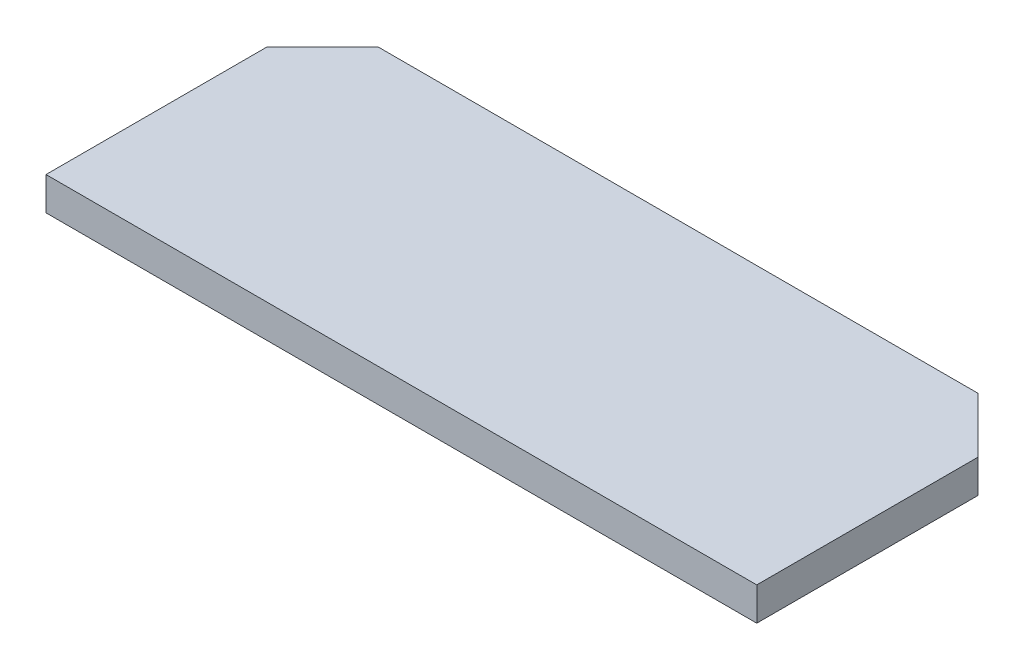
ISO-10303-21;
HEADER;
FILE_DESCRIPTION(('STEP AP214'),'2;1');
FILE_NAME('part.step','',(''),(''),'','','');
FILE_SCHEMA(('AUTOMOTIVE_DESIGN { 1 0 10303 214 1 1 1 1 }'));
ENDSEC;
DATA;
#1=APPLICATION_CONTEXT('core data for automotive mechanical design processes');
#2=APPLICATION_PROTOCOL_DEFINITION('international standard','automotive_design',2000,#1);
#3=PRODUCT_CONTEXT('',#1,'mechanical');
#4=PRODUCT('Part','Part','',(#3));
#5=PRODUCT_RELATED_PRODUCT_CATEGORY('part','',(#4));
#6=PRODUCT_DEFINITION_FORMATION('','',#4);
#7=PRODUCT_DEFINITION_CONTEXT('part definition',#1,'design');
#8=PRODUCT_DEFINITION('design','',#6,#7);
#9=PRODUCT_DEFINITION_SHAPE('','',#8);
#10=(LENGTH_UNIT() NAMED_UNIT(*) SI_UNIT(.MILLI.,.METRE.));
#11=(NAMED_UNIT(*) PLANE_ANGLE_UNIT() SI_UNIT($,.RADIAN.));
#12=(NAMED_UNIT(*) SI_UNIT($,.STERADIAN.) SOLID_ANGLE_UNIT());
#13=UNCERTAINTY_MEASURE_WITH_UNIT(LENGTH_MEASURE(1.E-05),#10,'distance_accuracy_value','');
#14=(GEOMETRIC_REPRESENTATION_CONTEXT(3) GLOBAL_UNCERTAINTY_ASSIGNED_CONTEXT((#13)) GLOBAL_UNIT_ASSIGNED_CONTEXT((#10,
#11,#12)) REPRESENTATION_CONTEXT('',''));
#15=CARTESIAN_POINT('',(0.,0.,0.));
#16=DIRECTION('',(0.,0.,1.));
#17=DIRECTION('',(1.,0.,0.));
#18=AXIS2_PLACEMENT_3D('',#15,#16,#17);
#19=CARTESIAN_POINT('',(0.,11.9999999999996,0.));
#20=DIRECTION('',(1.,0.,0.));
#21=DIRECTION('',(0.,0.,-1.));
#22=AXIS2_PLACEMENT_3D('',#19,#20,#21);
#23=PLANE('',#22);
#24=DIRECTION('',(0.,0.,1.));
#25=VECTOR('',#24,1.);
#26=CARTESIAN_POINT('',(0.,11.9999999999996,0.));
#27=LINE('',#26,#25);
#28=CARTESIAN_POINT('',(0.,11.9999999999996,20.));
#29=VERTEX_POINT('',#28);
#30=CARTESIAN_POINT('',(0.,11.9999999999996,100.));
#31=VERTEX_POINT('',#30);
#32=EDGE_CURVE('E88',#29,#31,#27,.T.);
#33=ORIENTED_EDGE('',*,*,#32,.F.);
#34=DIRECTION('',(0.,-1.,0.));
#35=VECTOR('',#34,1.);
#36=CARTESIAN_POINT('',(0.,11.9999999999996,20.));
#37=LINE('',#36,#35);
#38=CARTESIAN_POINT('',(0.,0.,20.));
#39=VERTEX_POINT('',#38);
#40=EDGE_CURVE('E111',#29,#39,#37,.T.);
#41=ORIENTED_EDGE('',*,*,#40,.T.);
#42=DIRECTION('',(0.,0.,1.));
#43=VECTOR('',#42,1.);
#44=CARTESIAN_POINT('',(0.,0.,0.));
#45=LINE('',#44,#43);
#46=CARTESIAN_POINT('',(0.,0.,100.));
#47=VERTEX_POINT('',#46);
#48=EDGE_CURVE('E109',#39,#47,#45,.T.);
#49=ORIENTED_EDGE('',*,*,#48,.T.);
#50=DIRECTION('',(0.,-1.,0.));
#51=VECTOR('',#50,1.);
#52=CARTESIAN_POINT('',(0.,11.9999999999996,100.));
#53=LINE('',#52,#51);
#54=EDGE_CURVE('E103',#31,#47,#53,.T.);
#55=ORIENTED_EDGE('',*,*,#54,.F.);
#56=EDGE_LOOP('',(#33,#41,#49,#55));
#57=FACE_BOUND('',#56,.T.);
#58=ADVANCED_FACE('F34',(#57),#23,.F.);
#59=CARTESIAN_POINT('',(0.,11.9999999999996,100.));
#60=DIRECTION('',(0.,0.,-1.));
#61=DIRECTION('',(-1.,0.,0.));
#62=AXIS2_PLACEMENT_3D('',#59,#60,#61);
#63=PLANE('',#62);
#64=DIRECTION('',(1.,0.,0.));
#65=VECTOR('',#64,1.);
#66=CARTESIAN_POINT('',(0.,0.,100.));
#67=LINE('',#66,#65);
#68=CARTESIAN_POINT('',(257.,0.,100.));
#69=VERTEX_POINT('',#68);
#70=EDGE_CURVE('E138',#47,#69,#67,.T.);
#71=ORIENTED_EDGE('',*,*,#70,.T.);
#72=DIRECTION('',(0.,-1.,0.));
#73=VECTOR('',#72,1.);
#74=CARTESIAN_POINT('',(257.,11.9999999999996,100.));
#75=LINE('',#74,#73);
#76=CARTESIAN_POINT('',(257.,11.9999999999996,100.));
#77=VERTEX_POINT('',#76);
#78=EDGE_CURVE('E105',#77,#69,#75,.T.);
#79=ORIENTED_EDGE('',*,*,#78,.F.);
#80=DIRECTION('',(1.,0.,0.));
#81=VECTOR('',#80,1.);
#82=CARTESIAN_POINT('',(0.,11.9999999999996,100.));
#83=LINE('',#82,#81);
#84=EDGE_CURVE('E91',#31,#77,#83,.T.);
#85=ORIENTED_EDGE('',*,*,#84,.F.);
#86=ORIENTED_EDGE('',*,*,#54,.T.);
#87=EDGE_LOOP('',(#71,#79,#85,#86));
#88=FACE_BOUND('',#87,.T.);
#89=ADVANCED_FACE('F102',(#88),#63,.F.);
#90=CARTESIAN_POINT('',(257.,11.9999999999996,-1.66533453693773E-13));
#91=DIRECTION('',(-1.,0.,0.));
#92=DIRECTION('',(0.,0.,1.));
#93=AXIS2_PLACEMENT_3D('',#90,#91,#92);
#94=PLANE('',#93);
#95=DIRECTION('',(0.,0.,-1.));
#96=VECTOR('',#95,1.);
#97=CARTESIAN_POINT('',(257.,0.,-1.66533453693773E-13));
#98=LINE('',#97,#96);
#99=CARTESIAN_POINT('',(257.,0.,19.9999999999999));
#100=VERTEX_POINT('',#99);
#101=EDGE_CURVE('E136',#69,#100,#98,.T.);
#102=ORIENTED_EDGE('',*,*,#101,.T.);
#103=DIRECTION('',(0.,1.,0.));
#104=VECTOR('',#103,1.);
#105=CARTESIAN_POINT('',(257.,11.9999999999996,19.9999999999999));
#106=LINE('',#105,#104);
#107=CARTESIAN_POINT('',(257.,11.9999999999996,19.9999999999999));
#108=VERTEX_POINT('',#107);
#109=EDGE_CURVE('E11',#100,#108,#106,.T.);
#110=ORIENTED_EDGE('',*,*,#109,.T.);
#111=DIRECTION('',(0.,0.,-1.));
#112=VECTOR('',#111,1.);
#113=CARTESIAN_POINT('',(257.,11.9999999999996,-1.66533453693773E-13));
#114=LINE('',#113,#112);
#115=EDGE_CURVE('E106',#77,#108,#114,.T.);
#116=ORIENTED_EDGE('',*,*,#115,.F.);
#117=ORIENTED_EDGE('',*,*,#78,.T.);
#118=EDGE_LOOP('',(#102,#110,#116,#117));
#119=FACE_BOUND('',#118,.T.);
#120=ADVANCED_FACE('F137',(#119),#94,.F.);
#121=CARTESIAN_POINT('',(0.,11.9999999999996,0.));
#122=DIRECTION('',(0.,0.,1.));
#123=DIRECTION('',(1.,0.,0.));
#124=AXIS2_PLACEMENT_3D('',#121,#122,#123);
#125=PLANE('',#124);
#126=DIRECTION('',(-1.,0.,0.));
#127=VECTOR('',#126,1.);
#128=CARTESIAN_POINT('',(0.,0.,0.));
#129=LINE('',#128,#127);
#130=CARTESIAN_POINT('',(237.,0.,-1.66533453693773E-13));
#131=VERTEX_POINT('',#130);
#132=CARTESIAN_POINT('',(20.0000000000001,0.,0.));
#133=VERTEX_POINT('',#132);
#134=EDGE_CURVE('E98',#131,#133,#129,.T.);
#135=ORIENTED_EDGE('',*,*,#134,.T.);
#136=DIRECTION('',(0.,1.,0.));
#137=VECTOR('',#136,1.);
#138=CARTESIAN_POINT('',(20.0000000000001,11.9999999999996,0.));
#139=LINE('',#138,#137);
#140=CARTESIAN_POINT('',(20.0000000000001,11.9999999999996,0.));
#141=VERTEX_POINT('',#140);
#142=EDGE_CURVE('E55',#133,#141,#139,.T.);
#143=ORIENTED_EDGE('',*,*,#142,.T.);
#144=DIRECTION('',(-1.,0.,0.));
#145=VECTOR('',#144,1.);
#146=CARTESIAN_POINT('',(0.,11.9999999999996,0.));
#147=LINE('',#146,#145);
#148=CARTESIAN_POINT('',(237.,11.9999999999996,-1.66533453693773E-13));
#149=VERTEX_POINT('',#148);
#150=EDGE_CURVE('E115',#149,#141,#147,.T.);
#151=ORIENTED_EDGE('',*,*,#150,.F.);
#152=DIRECTION('',(0.,-1.,0.));
#153=VECTOR('',#152,1.);
#154=CARTESIAN_POINT('',(237.,11.9999999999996,-1.66533453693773E-13));
#155=LINE('',#154,#153);
#156=EDGE_CURVE('E122',#149,#131,#155,.T.);
#157=ORIENTED_EDGE('',*,*,#156,.T.);
#158=EDGE_LOOP('',(#135,#143,#151,#157));
#159=FACE_BOUND('',#158,.T.);
#160=ADVANCED_FACE('F130',(#159),#125,.F.);
#161=CARTESIAN_POINT('',(0.,11.9999999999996,0.));
#162=DIRECTION('',(0.,1.,0.));
#163=DIRECTION('',(0.,0.,1.));
#164=AXIS2_PLACEMENT_3D('',#161,#162,#163);
#165=PLANE('',#164);
#166=ORIENTED_EDGE('',*,*,#150,.T.);
#167=DIRECTION('',(0.707106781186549,0.,-0.707106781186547));
#168=VECTOR('',#167,1.);
#169=CARTESIAN_POINT('',(10.,11.9999999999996,10.0000000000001));
#170=LINE('',#169,#168);
#171=EDGE_CURVE('E42',#141,#29,#170,.F.);
#172=ORIENTED_EDGE('',*,*,#171,.T.);
#173=ORIENTED_EDGE('',*,*,#32,.T.);
#174=ORIENTED_EDGE('',*,*,#84,.T.);
#175=ORIENTED_EDGE('',*,*,#115,.T.);
#176=DIRECTION('',(0.707106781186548,0.,0.707106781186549));
#177=VECTOR('',#176,1.);
#178=CARTESIAN_POINT('',(118.5,11.9999999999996,-118.5));
#179=LINE('',#178,#177);
#180=EDGE_CURVE('E126',#108,#149,#179,.F.);
#181=ORIENTED_EDGE('',*,*,#180,.T.);
#182=EDGE_LOOP('',(#166,#172,#173,#174,#175,#181));
#183=FACE_BOUND('',#182,.T.);
#184=ADVANCED_FACE('F90',(#183),#165,.T.);
#185=CARTESIAN_POINT('',(0.,0.,0.));
#186=DIRECTION('',(0.,1.,0.));
#187=DIRECTION('',(0.,0.,1.));
#188=AXIS2_PLACEMENT_3D('',#185,#186,#187);
#189=PLANE('',#188);
#190=ORIENTED_EDGE('',*,*,#48,.F.);
#191=DIRECTION('',(-0.707106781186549,0.,0.707106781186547));
#192=VECTOR('',#191,1.);
#193=CARTESIAN_POINT('',(0.,0.,20.));
#194=LINE('',#193,#192);
#195=EDGE_CURVE('E120',#39,#133,#194,.F.);
#196=ORIENTED_EDGE('',*,*,#195,.T.);
#197=ORIENTED_EDGE('',*,*,#134,.F.);
#198=DIRECTION('',(-0.707106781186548,0.,-0.707106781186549));
#199=VECTOR('',#198,1.);
#200=CARTESIAN_POINT('',(237.,0.,-1.66533453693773E-13));
#201=LINE('',#200,#199);
#202=EDGE_CURVE('E113',#131,#100,#201,.F.);
#203=ORIENTED_EDGE('',*,*,#202,.T.);
#204=ORIENTED_EDGE('',*,*,#101,.F.);
#205=ORIENTED_EDGE('',*,*,#70,.F.);
#206=EDGE_LOOP('',(#190,#196,#197,#203,#204,#205));
#207=FACE_BOUND('',#206,.T.);
#208=ADVANCED_FACE('F135',(#207),#189,.F.);
#209=CARTESIAN_POINT('',(0.,11.9999999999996,20.));
#210=DIRECTION('',(0.707106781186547,0.,0.707106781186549));
#211=DIRECTION('',(0.,-1.,0.));
#212=AXIS2_PLACEMENT_3D('',#209,#210,#211);
#213=PLANE('',#212);
#214=ORIENTED_EDGE('',*,*,#171,.F.);
#215=ORIENTED_EDGE('',*,*,#142,.F.);
#216=ORIENTED_EDGE('',*,*,#195,.F.);
#217=ORIENTED_EDGE('',*,*,#40,.F.);
#218=EDGE_LOOP('',(#214,#215,#216,#217));
#219=FACE_BOUND('',#218,.T.);
#220=ADVANCED_FACE('F144',(#219),#213,.F.);
#221=CARTESIAN_POINT('',(237.,11.9999999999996,-1.66533453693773E-13));
#222=DIRECTION('',(-0.707106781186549,0.,0.707106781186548));
#223=DIRECTION('',(0.,-1.,0.));
#224=AXIS2_PLACEMENT_3D('',#221,#222,#223);
#225=PLANE('',#224);
#226=ORIENTED_EDGE('',*,*,#180,.F.);
#227=ORIENTED_EDGE('',*,*,#109,.F.);
#228=ORIENTED_EDGE('',*,*,#202,.F.);
#229=ORIENTED_EDGE('',*,*,#156,.F.);
#230=EDGE_LOOP('',(#226,#227,#228,#229));
#231=FACE_BOUND('',#230,.T.);
#232=ADVANCED_FACE('F36',(#231),#225,.F.);
#233=CLOSED_SHELL('',(#58,#89,#120,#160,#184,#208,#220,#232));
#234=MANIFOLD_SOLID_BREP('B2',#233);
#235=ADVANCED_BREP_SHAPE_REPRESENTATION('',(#18,#234),#14);
#236=SHAPE_DEFINITION_REPRESENTATION(#9,#235);
ENDSEC;
END-ISO-10303-21;
